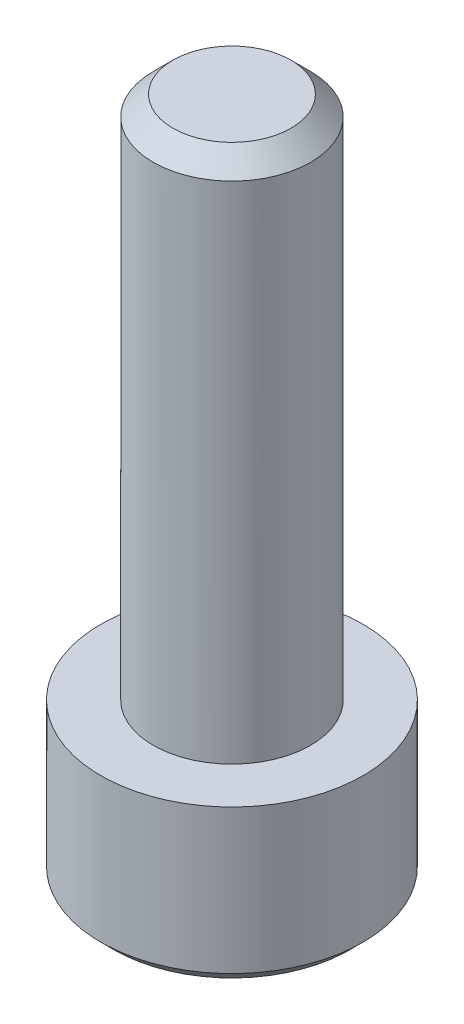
ISO-10303-21;
HEADER;
FILE_DESCRIPTION(('STEP AP214'),'2;1');
FILE_NAME('part.step','',(''),(''),'','','');
FILE_SCHEMA(('AUTOMOTIVE_DESIGN { 1 0 10303 214 1 1 1 1 }'));
ENDSEC;
DATA;
#1=APPLICATION_CONTEXT('core data for automotive mechanical design processes');
#2=APPLICATION_PROTOCOL_DEFINITION('international standard','automotive_design',2000,#1);
#3=PRODUCT_CONTEXT('',#1,'mechanical');
#4=PRODUCT('Part','Part','',(#3));
#5=PRODUCT_RELATED_PRODUCT_CATEGORY('part','',(#4));
#6=PRODUCT_DEFINITION_FORMATION('','',#4);
#7=PRODUCT_DEFINITION_CONTEXT('part definition',#1,'design');
#8=PRODUCT_DEFINITION('design','',#6,#7);
#9=PRODUCT_DEFINITION_SHAPE('','',#8);
#10=(LENGTH_UNIT() NAMED_UNIT(*) SI_UNIT(.MILLI.,.METRE.));
#11=(NAMED_UNIT(*) PLANE_ANGLE_UNIT() SI_UNIT($,.RADIAN.));
#12=(NAMED_UNIT(*) SI_UNIT($,.STERADIAN.) SOLID_ANGLE_UNIT());
#13=UNCERTAINTY_MEASURE_WITH_UNIT(LENGTH_MEASURE(1.E-05),#10,'distance_accuracy_value','');
#14=(GEOMETRIC_REPRESENTATION_CONTEXT(3) GLOBAL_UNCERTAINTY_ASSIGNED_CONTEXT((#13)) GLOBAL_UNIT_ASSIGNED_CONTEXT((#10,
#11,#12)) REPRESENTATION_CONTEXT('',''));
#15=CARTESIAN_POINT('',(0.,0.,0.));
#16=DIRECTION('',(0.,0.,1.));
#17=DIRECTION('',(1.,0.,0.));
#18=AXIS2_PLACEMENT_3D('',#15,#16,#17);
#19=CARTESIAN_POINT('',(-5.,6.00000000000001,0.));
#20=DIRECTION('',(0.,1.,0.));
#21=DIRECTION('',(0.,0.,1.));
#22=AXIS2_PLACEMENT_3D('',#19,#20,#21);
#23=PLANE('',#22);
#24=CARTESIAN_POINT('',(0.,6.00000000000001,0.));
#25=DIRECTION('',(0.,-1.,0.));
#26=DIRECTION('',(0.,0.,-1.));
#27=AXIS2_PLACEMENT_3D('',#24,#25,#26);
#28=CIRCLE('',#27,3.);
#29=CARTESIAN_POINT('',(0.,6.00000000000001,-3.));
#30=VERTEX_POINT('',#29);
#31=EDGE_CURVE('E149',#30,#30,#28,.T.);
#32=ORIENTED_EDGE('',*,*,#31,.T.);
#33=EDGE_LOOP('',(#32));
#34=FACE_BOUND('',#33,.T.);
#35=CARTESIAN_POINT('',(0.,6.00000000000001,0.));
#36=DIRECTION('',(0.,-1.,0.));
#37=DIRECTION('',(0.,0.,-1.));
#38=AXIS2_PLACEMENT_3D('',#35,#36,#37);
#39=CIRCLE('',#38,5.);
#40=CARTESIAN_POINT('',(0.,6.00000000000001,-5.));
#41=VERTEX_POINT('',#40);
#42=EDGE_CURVE('E140',#41,#41,#39,.T.);
#43=ORIENTED_EDGE('',*,*,#42,.F.);
#44=EDGE_LOOP('',(#43));
#45=FACE_BOUND('',#44,.T.);
#46=ADVANCED_FACE('F39',(#34,#45),#23,.T.);
#47=CARTESIAN_POINT('',(0.,-0.731448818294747,0.));
#48=DIRECTION('',(0.,-1.,0.));
#49=DIRECTION('',(0.,0.,-1.));
#50=AXIS2_PLACEMENT_3D('',#47,#48,#49);
#51=CYLINDRICAL_SURFACE('',#50,3.);
#52=CARTESIAN_POINT('',(0.,25.2499999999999,0.));
#53=DIRECTION('',(0.,1.,0.));
#54=DIRECTION('',(0.,0.,1.));
#55=AXIS2_PLACEMENT_3D('',#52,#53,#54);
#56=CIRCLE('',#55,3.);
#57=CARTESIAN_POINT('',(0.,25.2499999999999,3.));
#58=VERTEX_POINT('',#57);
#59=EDGE_CURVE('E152',#58,#58,#56,.F.);
#60=ORIENTED_EDGE('',*,*,#59,.T.);
#61=EDGE_LOOP('',(#60));
#62=FACE_BOUND('',#61,.T.);
#63=ORIENTED_EDGE('',*,*,#31,.F.);
#64=EDGE_LOOP('',(#63));
#65=FACE_BOUND('',#64,.T.);
#66=ADVANCED_FACE('F173',(#62,#65),#51,.T.);
#67=CARTESIAN_POINT('',(-3.,25.9999999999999,0.));
#68=DIRECTION('',(0.,1.,0.));
#69=DIRECTION('',(0.,0.,1.));
#70=AXIS2_PLACEMENT_3D('',#67,#68,#69);
#71=PLANE('',#70);
#72=CARTESIAN_POINT('',(0.,25.9999999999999,0.));
#73=DIRECTION('',(0.,1.,0.));
#74=DIRECTION('',(0.,0.,1.));
#75=AXIS2_PLACEMENT_3D('',#72,#73,#74);
#76=CIRCLE('',#75,2.24999999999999);
#77=CARTESIAN_POINT('',(0.,25.9999999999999,2.24999999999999));
#78=VERTEX_POINT('',#77);
#79=EDGE_CURVE('E155',#78,#78,#76,.T.);
#80=ORIENTED_EDGE('',*,*,#79,.T.);
#81=EDGE_LOOP('',(#80));
#82=FACE_BOUND('',#81,.T.);
#83=ADVANCED_FACE('F178',(#82),#71,.T.);
#84=CARTESIAN_POINT('',(0.,0.,0.));
#85=DIRECTION('',(0.,-1.,0.));
#86=DIRECTION('',(0.,0.,-1.));
#87=AXIS2_PLACEMENT_3D('',#84,#85,#86);
#88=PLANE('',#87);
#89=CARTESIAN_POINT('',(0.,0.,0.));
#90=DIRECTION('',(0.,-1.,0.));
#91=DIRECTION('',(0.,0.,-1.));
#92=AXIS2_PLACEMENT_3D('',#89,#90,#91);
#93=CIRCLE('',#92,4.49999999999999);
#94=CARTESIAN_POINT('',(0.,0.,-4.49999999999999));
#95=VERTEX_POINT('',#94);
#96=EDGE_CURVE('E46',#95,#95,#93,.T.);
#97=ORIENTED_EDGE('',*,*,#96,.T.);
#98=EDGE_LOOP('',(#97));
#99=FACE_BOUND('',#98,.T.);
#100=DIRECTION('',(0.499999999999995,0.,0.866025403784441));
#101=VECTOR('',#100,1.);
#102=CARTESIAN_POINT('',(1.44337567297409,0.,-2.49999999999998));
#103=LINE('',#102,#101);
#104=CARTESIAN_POINT('',(1.44337567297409,0.,-2.49999999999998));
#105=VERTEX_POINT('',#104);
#106=CARTESIAN_POINT('',(2.88675134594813,0.,0.));
#107=VERTEX_POINT('',#106);
#108=EDGE_CURVE('E53',#105,#107,#103,.T.);
#109=ORIENTED_EDGE('',*,*,#108,.F.);
#110=DIRECTION('',(1.,0.,0.));
#111=VECTOR('',#110,1.);
#112=CARTESIAN_POINT('',(-1.44337567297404,0.,-2.5));
#113=LINE('',#112,#111);
#114=CARTESIAN_POINT('',(-1.44337567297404,0.,-2.5));
#115=VERTEX_POINT('',#114);
#116=EDGE_CURVE('E122',#115,#105,#113,.T.);
#117=ORIENTED_EDGE('',*,*,#116,.F.);
#118=DIRECTION('',(0.500000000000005,0.,-0.866025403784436));
#119=VECTOR('',#118,1.);
#120=CARTESIAN_POINT('',(-2.88675134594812,0.,0.));
#121=LINE('',#120,#119);
#122=CARTESIAN_POINT('',(-2.88675134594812,0.,0.));
#123=VERTEX_POINT('',#122);
#124=EDGE_CURVE('E116',#123,#115,#121,.T.);
#125=ORIENTED_EDGE('',*,*,#124,.F.);
#126=DIRECTION('',(-0.499999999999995,0.,-0.866025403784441));
#127=VECTOR('',#126,1.);
#128=CARTESIAN_POINT('',(-1.44337567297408,0.,2.49999999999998));
#129=LINE('',#128,#127);
#130=CARTESIAN_POINT('',(-1.44337567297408,0.,2.49999999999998));
#131=VERTEX_POINT('',#130);
#132=EDGE_CURVE('E114',#131,#123,#129,.T.);
#133=ORIENTED_EDGE('',*,*,#132,.F.);
#134=DIRECTION('',(-1.,0.,0.));
#135=VECTOR('',#134,1.);
#136=CARTESIAN_POINT('',(1.44337567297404,0.,2.5));
#137=LINE('',#136,#135);
#138=CARTESIAN_POINT('',(1.44337567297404,0.,2.5));
#139=VERTEX_POINT('',#138);
#140=EDGE_CURVE('E96',#139,#131,#137,.T.);
#141=ORIENTED_EDGE('',*,*,#140,.F.);
#142=DIRECTION('',(-0.500000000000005,0.,0.866025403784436));
#143=VECTOR('',#142,1.);
#144=CARTESIAN_POINT('',(2.88675134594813,0.,0.));
#145=LINE('',#144,#143);
#146=EDGE_CURVE('E107',#107,#139,#145,.T.);
#147=ORIENTED_EDGE('',*,*,#146,.F.);
#148=EDGE_LOOP('',(#109,#117,#125,#133,#141,#147));
#149=FACE_BOUND('',#148,.T.);
#150=ADVANCED_FACE('F111',(#99,#149),#88,.T.);
#151=CARTESIAN_POINT('',(0.,-0.731448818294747,0.));
#152=DIRECTION('',(0.,-1.,0.));
#153=DIRECTION('',(0.,0.,-1.));
#154=AXIS2_PLACEMENT_3D('',#151,#152,#153);
#155=CYLINDRICAL_SURFACE('',#154,5.);
#156=CARTESIAN_POINT('',(0.,0.5,0.));
#157=DIRECTION('',(0.,-1.,0.));
#158=DIRECTION('',(0.,0.,-1.));
#159=AXIS2_PLACEMENT_3D('',#156,#157,#158);
#160=CIRCLE('',#159,5.);
#161=CARTESIAN_POINT('',(0.,0.5,-5.));
#162=VERTEX_POINT('',#161);
#163=EDGE_CURVE('E11',#162,#162,#160,.F.);
#164=ORIENTED_EDGE('',*,*,#163,.T.);
#165=EDGE_LOOP('',(#164));
#166=FACE_BOUND('',#165,.T.);
#167=ORIENTED_EDGE('',*,*,#42,.T.);
#168=EDGE_LOOP('',(#167));
#169=FACE_BOUND('',#168,.T.);
#170=ADVANCED_FACE('F184',(#166,#169),#155,.T.);
#171=CARTESIAN_POINT('',(0.,25.2499999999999,0.));
#172=DIRECTION('',(0.,-1.,0.));
#173=DIRECTION('',(0.,0.,-1.));
#174=AXIS2_PLACEMENT_3D('',#171,#172,#173);
#175=CONICAL_SURFACE('',#174,3.,0.785398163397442);
#176=ORIENTED_EDGE('',*,*,#79,.F.);
#177=EDGE_LOOP('',(#176));
#178=FACE_BOUND('',#177,.T.);
#179=ORIENTED_EDGE('',*,*,#59,.F.);
#180=EDGE_LOOP('',(#179));
#181=FACE_BOUND('',#180,.T.);
#182=ADVANCED_FACE('F186',(#178,#181),#175,.T.);
#183=CARTESIAN_POINT('',(1.44337567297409,5.,-2.50000000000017));
#184=DIRECTION('',(0.866025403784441,0.,-0.499999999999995));
#185=DIRECTION('',(-0.499999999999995,0.,-0.866025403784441));
#186=AXIS2_PLACEMENT_3D('',#183,#184,#185);
#187=PLANE('',#186);
#188=ORIENTED_EDGE('',*,*,#108,.T.);
#189=DIRECTION('',(0.,-1.,0.));
#190=VECTOR('',#189,1.);
#191=CARTESIAN_POINT('',(2.88675134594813,5.,0.));
#192=LINE('',#191,#190);
#193=CARTESIAN_POINT('',(2.88675134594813,5.,0.));
#194=VERTEX_POINT('',#193);
#195=EDGE_CURVE('E104',#194,#107,#192,.T.);
#196=ORIENTED_EDGE('',*,*,#195,.F.);
#197=DIRECTION('',(0.499999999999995,0.,0.866025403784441));
#198=VECTOR('',#197,1.);
#199=CARTESIAN_POINT('',(1.44337567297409,5.,-2.50000000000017));
#200=LINE('',#199,#198);
#201=CARTESIAN_POINT('',(1.44337567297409,5.,-2.50000000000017));
#202=VERTEX_POINT('',#201);
#203=EDGE_CURVE('E124',#202,#194,#200,.T.);
#204=ORIENTED_EDGE('',*,*,#203,.F.);
#205=DIRECTION('',(0.,-1.,0.));
#206=VECTOR('',#205,1.);
#207=CARTESIAN_POINT('',(1.44337567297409,5.,-2.50000000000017));
#208=LINE('',#207,#206);
#209=EDGE_CURVE('E60',#202,#105,#208,.T.);
#210=ORIENTED_EDGE('',*,*,#209,.T.);
#211=EDGE_LOOP('',(#188,#196,#204,#210));
#212=FACE_BOUND('',#211,.T.);
#213=ADVANCED_FACE('F193',(#212),#187,.F.);
#214=CARTESIAN_POINT('',(-1.44337567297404,5.,-2.50000000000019));
#215=DIRECTION('',(0.,0.,-1.));
#216=DIRECTION('',(-1.,0.,0.));
#217=AXIS2_PLACEMENT_3D('',#214,#215,#216);
#218=PLANE('',#217);
#219=ORIENTED_EDGE('',*,*,#116,.T.);
#220=ORIENTED_EDGE('',*,*,#209,.F.);
#221=DIRECTION('',(1.,0.,0.));
#222=VECTOR('',#221,1.);
#223=CARTESIAN_POINT('',(-1.44337567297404,5.,-2.50000000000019));
#224=LINE('',#223,#222);
#225=CARTESIAN_POINT('',(-1.44337567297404,5.,-2.50000000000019));
#226=VERTEX_POINT('',#225);
#227=EDGE_CURVE('E136',#226,#202,#224,.T.);
#228=ORIENTED_EDGE('',*,*,#227,.F.);
#229=DIRECTION('',(0.,-1.,0.));
#230=VECTOR('',#229,1.);
#231=CARTESIAN_POINT('',(-1.44337567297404,5.,-2.50000000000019));
#232=LINE('',#231,#230);
#233=EDGE_CURVE('E141',#226,#115,#232,.T.);
#234=ORIENTED_EDGE('',*,*,#233,.T.);
#235=EDGE_LOOP('',(#219,#220,#228,#234));
#236=FACE_BOUND('',#235,.T.);
#237=ADVANCED_FACE('F232',(#236),#218,.F.);
#238=CARTESIAN_POINT('',(-2.88675134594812,5.,0.));
#239=DIRECTION('',(-0.866025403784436,0.,-0.500000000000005));
#240=DIRECTION('',(-0.500000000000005,0.,0.866025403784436));
#241=AXIS2_PLACEMENT_3D('',#238,#239,#240);
#242=PLANE('',#241);
#243=ORIENTED_EDGE('',*,*,#124,.T.);
#244=ORIENTED_EDGE('',*,*,#233,.F.);
#245=DIRECTION('',(0.500000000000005,0.,-0.866025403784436));
#246=VECTOR('',#245,1.);
#247=CARTESIAN_POINT('',(-2.88675134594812,5.,0.));
#248=LINE('',#247,#246);
#249=CARTESIAN_POINT('',(-2.88675134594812,5.,0.));
#250=VERTEX_POINT('',#249);
#251=EDGE_CURVE('E133',#250,#226,#248,.T.);
#252=ORIENTED_EDGE('',*,*,#251,.F.);
#253=DIRECTION('',(0.,-1.,0.));
#254=VECTOR('',#253,1.);
#255=CARTESIAN_POINT('',(-2.88675134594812,5.,0.));
#256=LINE('',#255,#254);
#257=EDGE_CURVE('E143',#250,#123,#256,.T.);
#258=ORIENTED_EDGE('',*,*,#257,.T.);
#259=EDGE_LOOP('',(#243,#244,#252,#258));
#260=FACE_BOUND('',#259,.T.);
#261=ADVANCED_FACE('F240',(#260),#242,.F.);
#262=CARTESIAN_POINT('',(-1.44337567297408,5.,2.49999999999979));
#263=DIRECTION('',(-0.866025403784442,0.,0.499999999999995));
#264=DIRECTION('',(0.499999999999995,0.,0.866025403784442));
#265=AXIS2_PLACEMENT_3D('',#262,#263,#264);
#266=PLANE('',#265);
#267=ORIENTED_EDGE('',*,*,#132,.T.);
#268=ORIENTED_EDGE('',*,*,#257,.F.);
#269=DIRECTION('',(-0.499999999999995,0.,-0.866025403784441));
#270=VECTOR('',#269,1.);
#271=CARTESIAN_POINT('',(-1.44337567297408,5.,2.49999999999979));
#272=LINE('',#271,#270);
#273=CARTESIAN_POINT('',(-1.44337567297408,5.,2.49999999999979));
#274=VERTEX_POINT('',#273);
#275=EDGE_CURVE('E130',#274,#250,#272,.T.);
#276=ORIENTED_EDGE('',*,*,#275,.F.);
#277=DIRECTION('',(0.,-1.,0.));
#278=VECTOR('',#277,1.);
#279=CARTESIAN_POINT('',(-1.44337567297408,5.,2.49999999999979));
#280=LINE('',#279,#278);
#281=EDGE_CURVE('E103',#274,#131,#280,.T.);
#282=ORIENTED_EDGE('',*,*,#281,.T.);
#283=EDGE_LOOP('',(#267,#268,#276,#282));
#284=FACE_BOUND('',#283,.T.);
#285=ADVANCED_FACE('F249',(#284),#266,.F.);
#286=CARTESIAN_POINT('',(1.44337567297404,5.,2.49999999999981));
#287=DIRECTION('',(0.,0.,1.));
#288=DIRECTION('',(1.,0.,0.));
#289=AXIS2_PLACEMENT_3D('',#286,#287,#288);
#290=PLANE('',#289);
#291=ORIENTED_EDGE('',*,*,#140,.T.);
#292=ORIENTED_EDGE('',*,*,#281,.F.);
#293=DIRECTION('',(-1.,0.,0.));
#294=VECTOR('',#293,1.);
#295=CARTESIAN_POINT('',(1.44337567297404,5.,2.49999999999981));
#296=LINE('',#295,#294);
#297=CARTESIAN_POINT('',(1.44337567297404,5.,2.49999999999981));
#298=VERTEX_POINT('',#297);
#299=EDGE_CURVE('E99',#298,#274,#296,.T.);
#300=ORIENTED_EDGE('',*,*,#299,.F.);
#301=DIRECTION('',(0.,-1.,0.));
#302=VECTOR('',#301,1.);
#303=CARTESIAN_POINT('',(1.44337567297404,5.,2.49999999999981));
#304=LINE('',#303,#302);
#305=EDGE_CURVE('E92',#298,#139,#304,.T.);
#306=ORIENTED_EDGE('',*,*,#305,.T.);
#307=EDGE_LOOP('',(#291,#292,#300,#306));
#308=FACE_BOUND('',#307,.T.);
#309=ADVANCED_FACE('F94',(#308),#290,.F.);
#310=CARTESIAN_POINT('',(2.88675134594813,5.,0.));
#311=DIRECTION('',(0.866025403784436,0.,0.500000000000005));
#312=DIRECTION('',(0.500000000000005,0.,-0.866025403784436));
#313=AXIS2_PLACEMENT_3D('',#310,#311,#312);
#314=PLANE('',#313);
#315=ORIENTED_EDGE('',*,*,#146,.T.);
#316=ORIENTED_EDGE('',*,*,#305,.F.);
#317=DIRECTION('',(-0.500000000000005,0.,0.866025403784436));
#318=VECTOR('',#317,1.);
#319=CARTESIAN_POINT('',(2.88675134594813,5.,0.));
#320=LINE('',#319,#318);
#321=EDGE_CURVE('E127',#194,#298,#320,.T.);
#322=ORIENTED_EDGE('',*,*,#321,.F.);
#323=ORIENTED_EDGE('',*,*,#195,.T.);
#324=EDGE_LOOP('',(#315,#316,#322,#323));
#325=FACE_BOUND('',#324,.T.);
#326=ADVANCED_FACE('F108',(#325),#314,.F.);
#327=CARTESIAN_POINT('',(0.,4.99999999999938,-5.00000000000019));
#328=DIRECTION('',(0.,1.,0.));
#329=DIRECTION('',(0.,0.,1.));
#330=AXIS2_PLACEMENT_3D('',#327,#328,#329);
#331=PLANE('',#330);
#332=ORIENTED_EDGE('',*,*,#203,.T.);
#333=ORIENTED_EDGE('',*,*,#321,.T.);
#334=ORIENTED_EDGE('',*,*,#299,.T.);
#335=ORIENTED_EDGE('',*,*,#275,.T.);
#336=ORIENTED_EDGE('',*,*,#251,.T.);
#337=ORIENTED_EDGE('',*,*,#227,.T.);
#338=EDGE_LOOP('',(#332,#333,#334,#335,#336,#337));
#339=FACE_BOUND('',#338,.T.);
#340=ADVANCED_FACE('F163',(#339),#331,.F.);
#341=CARTESIAN_POINT('',(0.,0.,0.));
#342=DIRECTION('',(0.,1.,0.));
#343=DIRECTION('',(0.,0.,1.));
#344=AXIS2_PLACEMENT_3D('',#341,#342,#343);
#345=CONICAL_SURFACE('',#344,4.49999999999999,0.785398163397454);
#346=ORIENTED_EDGE('',*,*,#163,.F.);
#347=EDGE_LOOP('',(#346));
#348=FACE_BOUND('',#347,.T.);
#349=ORIENTED_EDGE('',*,*,#96,.F.);
#350=EDGE_LOOP('',(#349));
#351=FACE_BOUND('',#350,.T.);
#352=ADVANCED_FACE('F161',(#348,#351),#345,.T.);
#353=CLOSED_SHELL('',(#46,#66,#83,#150,#170,#182,#213,#237,#261,#285,#309,#326,#340,#352));
#354=MANIFOLD_SOLID_BREP('B2',#353);
#355=ADVANCED_BREP_SHAPE_REPRESENTATION('',(#18,#354),#14);
#356=SHAPE_DEFINITION_REPRESENTATION(#9,#355);
ENDSEC;
END-ISO-10303-21;
